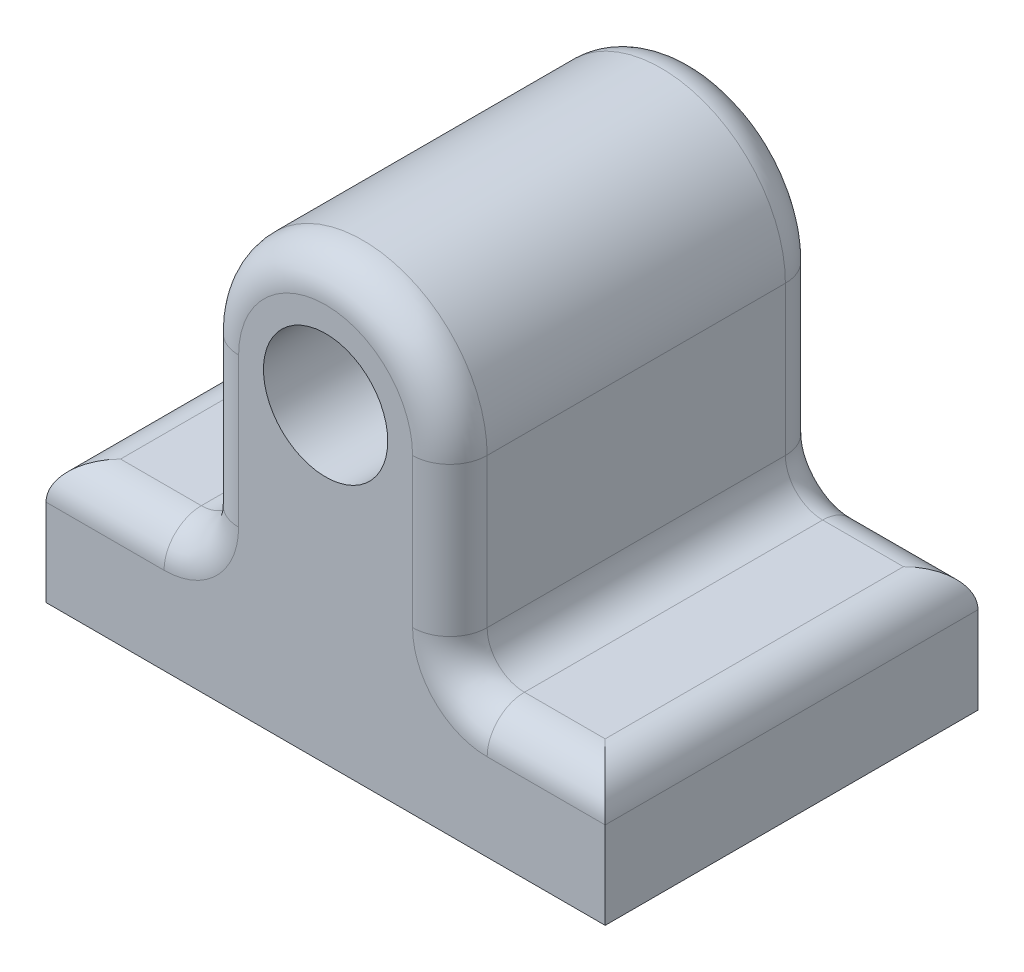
from build123d import *

# Parameters (mm, degrees)
SKETCH1_R           = 5
BOSS_EXTRUDE1_DEPTH = 30
FILLET1_R           = 3


with BuildPart() as part:
    # Sketch1 → Boss-Extrude1 (new body)
    with BuildSketch(Plane.XY):
        with BuildLine():
            Line((70, 15), (70, 0))
            Line((70, 0), (57.5, 0))
            Line((57.5, 0), (57.5, -10))
            Line((57.5, -10), (102.5, -10))
            Line((102.5, -10), (102.5, 0))
            Line((102.5, 0), (90, 0))
            Line((90, 0), (90, 15))
            ThreePointArc((90, 15), (80, 25), (70, 15))
        make_face()
        with Locations((80, 15)):
            Circle(SKETCH1_R, mode=Mode.SUBTRACT)
    extrude(amount=BOSS_EXTRUDE1_DEPTH)

    # Fillet1
    fillet1_edges = [part.edges().sort_by_distance(p)[0] for p in [
        (63.75, 0, 30),
        (70, 7.5, 0),
        (80, 25, 0),
        (90, 0, 15),
        (102.5, 0, 15),
        (57.5, 0, 15),
        (70, 0, 15),
        (96.25, 0, 30),
        (90, 7.5, 30),
        (80, 25, 30),
        (70, 7.5, 30),
        (90, 7.5, 0),
        (96.25, 0, 0),
        (63.75, 0, 0),
    ]]
    fillet(fillet1_edges, radius=FILLET1_R)


solid = part.part
